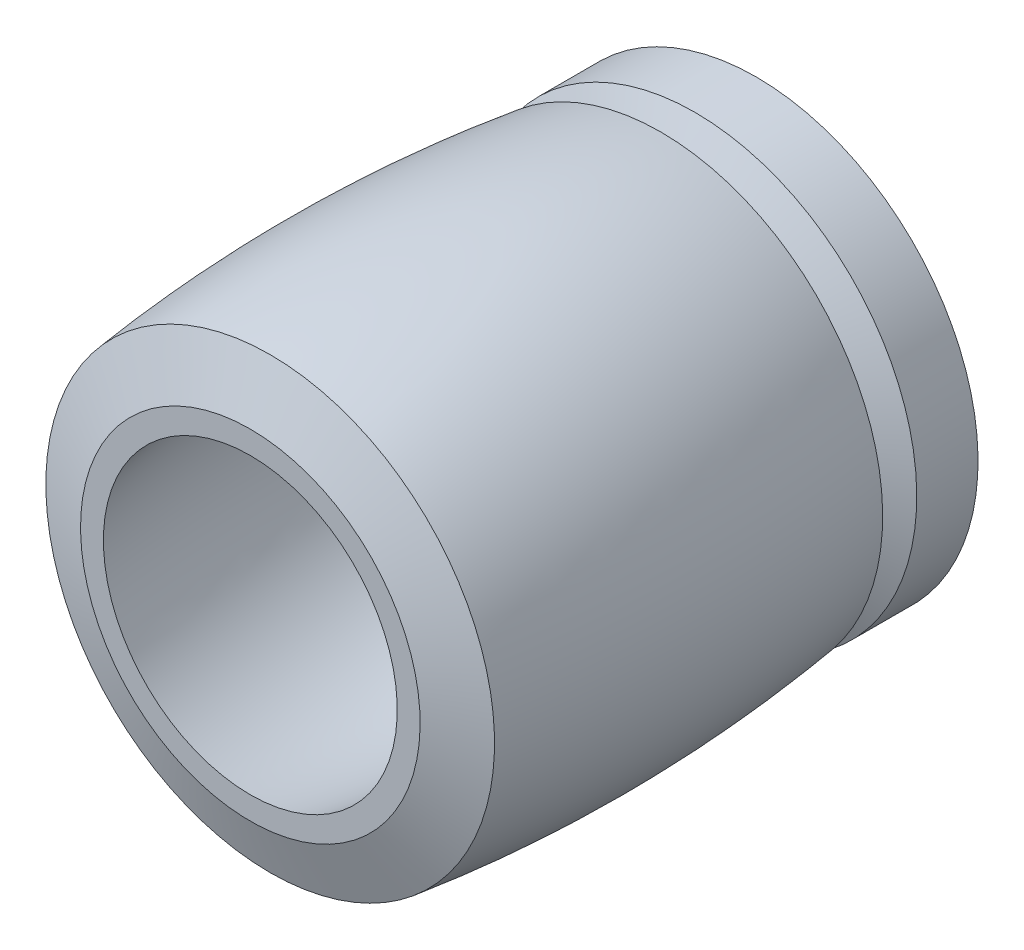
ISO-10303-21;
HEADER;
FILE_DESCRIPTION(('STEP AP214'),'2;1');
FILE_NAME('part.step','',(''),(''),'','','');
FILE_SCHEMA(('AUTOMOTIVE_DESIGN { 1 0 10303 214 1 1 1 1 }'));
ENDSEC;
DATA;
#1=APPLICATION_CONTEXT('core data for automotive mechanical design processes');
#2=APPLICATION_PROTOCOL_DEFINITION('international standard','automotive_design',2000,#1);
#3=PRODUCT_CONTEXT('',#1,'mechanical');
#4=PRODUCT('Part','Part','',(#3));
#5=PRODUCT_RELATED_PRODUCT_CATEGORY('part','',(#4));
#6=PRODUCT_DEFINITION_FORMATION('','',#4);
#7=PRODUCT_DEFINITION_CONTEXT('part definition',#1,'design');
#8=PRODUCT_DEFINITION('design','',#6,#7);
#9=PRODUCT_DEFINITION_SHAPE('','',#8);
#10=(LENGTH_UNIT() NAMED_UNIT(*) SI_UNIT(.MILLI.,.METRE.));
#11=(NAMED_UNIT(*) PLANE_ANGLE_UNIT() SI_UNIT($,.RADIAN.));
#12=(NAMED_UNIT(*) SI_UNIT($,.STERADIAN.) SOLID_ANGLE_UNIT());
#13=UNCERTAINTY_MEASURE_WITH_UNIT(LENGTH_MEASURE(1.E-05),#10,'distance_accuracy_value','');
#14=(GEOMETRIC_REPRESENTATION_CONTEXT(3) GLOBAL_UNCERTAINTY_ASSIGNED_CONTEXT((#13)) GLOBAL_UNIT_ASSIGNED_CONTEXT((#10,
#11,#12)) REPRESENTATION_CONTEXT('',''));
#15=CARTESIAN_POINT('',(0.,0.,0.));
#16=DIRECTION('',(0.,0.,1.));
#17=DIRECTION('',(1.,0.,0.));
#18=AXIS2_PLACEMENT_3D('',#15,#16,#17);
#19=CARTESIAN_POINT('',(0.,0.,0.));
#20=DIRECTION('',(0.,0.,-1.));
#21=DIRECTION('',(0.,1.,0.));
#22=AXIS2_PLACEMENT_3D('',#19,#20,#21);
#23=CYLINDRICAL_SURFACE('',#22,2.667);
#24=CARTESIAN_POINT('',(0.,0.,0.));
#25=DIRECTION('',(0.,0.,-1.));
#26=DIRECTION('',(0.,1.,0.));
#27=AXIS2_PLACEMENT_3D('',#24,#25,#26);
#28=CIRCLE('',#27,2.667);
#29=CARTESIAN_POINT('',(0.,2.667,0.));
#30=VERTEX_POINT('',#29);
#31=EDGE_CURVE('E15',#30,#30,#28,.F.);
#32=ORIENTED_EDGE('',*,*,#31,.F.);
#33=EDGE_LOOP('',(#32));
#34=FACE_BOUND('',#33,.T.);
#35=CARTESIAN_POINT('',(0.,0.,3.49580200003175));
#36=DIRECTION('',(0.,0.,1.));
#37=DIRECTION('',(0.,-1.,0.));
#38=AXIS2_PLACEMENT_3D('',#35,#36,#37);
#39=CIRCLE('',#38,2.66700000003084);
#40=CARTESIAN_POINT('',(0.,-2.66700000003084,3.49580200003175));
#41=VERTEX_POINT('',#40);
#42=EDGE_CURVE('E99',#41,#41,#39,.T.);
#43=ORIENTED_EDGE('',*,*,#42,.T.);
#44=EDGE_LOOP('',(#43));
#45=FACE_BOUND('',#44,.T.);
#46=ADVANCED_FACE('F12',(#34,#45),#23,.F.);
#47=CARTESIAN_POINT('',(0.,0.,4.59362645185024));
#48=DIRECTION('',(0.,0.,1.));
#49=DIRECTION('',(0.,-1.,0.));
#50=AXIS2_PLACEMENT_3D('',#47,#48,#49);
#51=CONICAL_SURFACE('',#50,5.68324789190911,1.22173047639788);
#52=CARTESIAN_POINT('',(0.,0.,4.59362645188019));
#53=DIRECTION('',(0.,0.,-1.));
#54=DIRECTION('',(0.,1.,0.));
#55=AXIS2_PLACEMENT_3D('',#52,#53,#54);
#56=CIRCLE('',#55,5.68324789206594);
#57=CARTESIAN_POINT('',(0.,5.68324789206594,4.59362645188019));
#58=VERTEX_POINT('',#57);
#59=EDGE_CURVE('E96',#58,#58,#56,.F.);
#60=ORIENTED_EDGE('',*,*,#59,.T.);
#61=EDGE_LOOP('',(#60));
#62=FACE_BOUND('',#61,.T.);
#63=ORIENTED_EDGE('',*,*,#42,.F.);
#64=EDGE_LOOP('',(#63));
#65=FACE_BOUND('',#64,.T.);
#66=ADVANCED_FACE('F46',(#62,#65),#51,.F.);
#67=CARTESIAN_POINT('',(2.667,0.,0.));
#68=DIRECTION('',(0.,0.,-1.));
#69=DIRECTION('',(0.,1.,0.));
#70=AXIS2_PLACEMENT_3D('',#67,#68,#69);
#71=PLANE('',#70);
#72=ORIENTED_EDGE('',*,*,#31,.T.);
#73=EDGE_LOOP('',(#72));
#74=FACE_BOUND('',#73,.T.);
#75=CARTESIAN_POINT('',(0.,0.,0.));
#76=DIRECTION('',(0.,0.,-1.));
#77=DIRECTION('',(0.,1.,0.));
#78=AXIS2_PLACEMENT_3D('',#75,#76,#77);
#79=CIRCLE('',#78,8.128);
#80=CARTESIAN_POINT('',(0.,8.128,0.));
#81=VERTEX_POINT('',#80);
#82=EDGE_CURVE('E92',#81,#81,#79,.F.);
#83=ORIENTED_EDGE('',*,*,#82,.F.);
#84=EDGE_LOOP('',(#83));
#85=FACE_BOUND('',#84,.T.);
#86=ADVANCED_FACE('F42',(#74,#85),#71,.T.);
#87=CARTESIAN_POINT('',(0.,-49.8961682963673,10.3817950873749));
#88=DIRECTION('',(1.,0.,0.));
#89=DIRECTION('',(0.,1.,0.));
#90=AXIS2_PLACEMENT_3D('',#87,#88,#89);
#91=CIRCLE('',#90,55.88);
#92=TRIMMED_CURVE('',#91,(PARAMETER_VALUE(-0.467014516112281)),
(PARAMETER_VALUE(0.467014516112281)),.T.,.PARAMETER.);
#93=CARTESIAN_POINT('',(0.,0.,10.3817950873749));
#94=DIRECTION('',(0.,0.,-1.));
#95=AXIS1_PLACEMENT('',#93,#94);
#96=SURFACE_OF_REVOLUTION('',#92,#95);
#97=ORIENTED_EDGE('',*,*,#59,.F.);
#98=EDGE_LOOP('',(#97));
#99=FACE_BOUND('',#98,.T.);
#100=CARTESIAN_POINT('',(0.,0.,18.542));
#101=DIRECTION('',(0.,0.,-1.));
#102=DIRECTION('',(0.,1.,0.));
#103=AXIS2_PLACEMENT_3D('',#100,#101,#102);
#104=CIRCLE('',#103,5.3848);
#105=CARTESIAN_POINT('',(0.,5.3848,18.542));
#106=VERTEX_POINT('',#105);
#107=EDGE_CURVE('E90',#106,#106,#104,.T.);
#108=ORIENTED_EDGE('',*,*,#107,.F.);
#109=EDGE_LOOP('',(#108));
#110=FACE_BOUND('',#109,.T.);
#111=ADVANCED_FACE('F37',(#99,#110),#96,.T.);
#112=CARTESIAN_POINT('',(0.,0.,0.));
#113=DIRECTION('',(0.,0.,-1.));
#114=DIRECTION('',(0.,1.,0.));
#115=AXIS2_PLACEMENT_3D('',#112,#113,#114);
#116=CYLINDRICAL_SURFACE('',#115,8.128);
#117=ORIENTED_EDGE('',*,*,#82,.T.);
#118=EDGE_LOOP('',(#117));
#119=FACE_BOUND('',#118,.T.);
#120=CARTESIAN_POINT('',(0.,0.,2.245868));
#121=DIRECTION('',(0.,0.,-1.));
#122=DIRECTION('',(0.,1.,0.));
#123=AXIS2_PLACEMENT_3D('',#120,#121,#122);
#124=CIRCLE('',#123,8.128);
#125=CARTESIAN_POINT('',(0.,8.128,2.245868));
#126=VERTEX_POINT('',#125);
#127=EDGE_CURVE('E34',#126,#126,#124,.F.);
#128=ORIENTED_EDGE('',*,*,#127,.F.);
#129=EDGE_LOOP('',(#128));
#130=FACE_BOUND('',#129,.T.);
#131=ADVANCED_FACE('F41',(#119,#130),#116,.T.);
#132=CARTESIAN_POINT('',(5.3848,0.,18.542));
#133=DIRECTION('',(0.,0.,1.));
#134=DIRECTION('',(0.,-1.,0.));
#135=AXIS2_PLACEMENT_3D('',#132,#133,#134);
#136=PLANE('',#135);
#137=CARTESIAN_POINT('',(0.,0.,18.542));
#138=DIRECTION('',(0.,0.,-1.));
#139=DIRECTION('',(0.,1.,0.));
#140=AXIS2_PLACEMENT_3D('',#137,#138,#139);
#141=CIRCLE('',#140,6.223);
#142=CARTESIAN_POINT('',(0.,6.223,18.542));
#143=VERTEX_POINT('',#142);
#144=EDGE_CURVE('E31',#143,#143,#141,.T.);
#145=ORIENTED_EDGE('',*,*,#144,.F.);
#146=EDGE_LOOP('',(#145));
#147=FACE_BOUND('',#146,.T.);
#148=ORIENTED_EDGE('',*,*,#107,.T.);
#149=EDGE_LOOP('',(#148));
#150=FACE_BOUND('',#149,.T.);
#151=ADVANCED_FACE('F76',(#147,#150),#136,.T.);
#152=CARTESIAN_POINT('',(0.,0.,2.245868));
#153=DIRECTION('',(0.,0.,-1.));
#154=DIRECTION('',(0.,1.,0.));
#155=AXIS2_PLACEMENT_3D('',#152,#153,#154);
#156=CONICAL_SURFACE('',#155,8.128,1.13446401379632);
#157=ORIENTED_EDGE('',*,*,#127,.T.);
#158=EDGE_LOOP('',(#157));
#159=FACE_BOUND('',#158,.T.);
#160=CARTESIAN_POINT('',(0.,0.,2.87083500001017));
#161=DIRECTION('',(0.,0.,1.));
#162=DIRECTION('',(0.,-1.,0.));
#163=AXIS2_PLACEMENT_3D('',#160,#161,#162);
#164=CIRCLE('',#163,6.78775394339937);
#165=CARTESIAN_POINT('',(0.,-6.78775394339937,2.87083500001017));
#166=VERTEX_POINT('',#165);
#167=EDGE_CURVE('E24',#166,#166,#164,.T.);
#168=ORIENTED_EDGE('',*,*,#167,.F.);
#169=EDGE_LOOP('',(#168));
#170=FACE_BOUND('',#169,.T.);
#171=ADVANCED_FACE('F73',(#159,#170),#156,.T.);
#172=CARTESIAN_POINT('',(0.,0.,17.8144307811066));
#173=DIRECTION('',(0.,0.,-1.));
#174=DIRECTION('',(0.,1.,0.));
#175=AXIS2_PLACEMENT_3D('',#172,#173,#174);
#176=CONICAL_SURFACE('',#175,8.22198,1.22173047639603);
#177=CARTESIAN_POINT('',(0.,0.,17.8144307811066));
#178=DIRECTION('',(0.,0.,-1.));
#179=DIRECTION('',(0.,1.,0.));
#180=AXIS2_PLACEMENT_3D('',#177,#178,#179);
#181=CIRCLE('',#180,8.22198);
#182=CARTESIAN_POINT('',(0.,8.22198,17.8144307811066));
#183=VERTEX_POINT('',#182);
#184=EDGE_CURVE('E19',#183,#183,#181,.T.);
#185=ORIENTED_EDGE('',*,*,#184,.F.);
#186=EDGE_LOOP('',(#185));
#187=FACE_BOUND('',#186,.T.);
#188=ORIENTED_EDGE('',*,*,#144,.T.);
#189=EDGE_LOOP('',(#188));
#190=FACE_BOUND('',#189,.T.);
#191=ADVANCED_FACE('F66',(#187,#190),#176,.T.);
#192=CARTESIAN_POINT('',(0.,0.,3.49580200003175));
#193=DIRECTION('',(0.,0.,1.));
#194=DIRECTION('',(-1.,0.,0.));
#195=AXIS2_PLACEMENT_3D('',#192,#193,#194);
#196=CONICAL_SURFACE('',#195,8.12800000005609,1.13446401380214);
#197=CARTESIAN_POINT('',(0.,0.,3.495802));
#198=DIRECTION('',(0.,0.,-1.));
#199=DIRECTION('',(0.,1.,0.));
#200=AXIS2_PLACEMENT_3D('',#197,#198,#199);
#201=CIRCLE('',#200,8.128);
#202=CARTESIAN_POINT('',(0.,8.128,3.495802));
#203=VERTEX_POINT('',#202);
#204=EDGE_CURVE('E8',#203,#203,#201,.F.);
#205=ORIENTED_EDGE('',*,*,#204,.F.);
#206=EDGE_LOOP('',(#205));
#207=FACE_BOUND('',#206,.T.);
#208=ORIENTED_EDGE('',*,*,#167,.T.);
#209=EDGE_LOOP('',(#208));
#210=FACE_BOUND('',#209,.T.);
#211=ADVANCED_FACE('F60',(#207,#210),#196,.T.);
#212=CARTESIAN_POINT('',(0.,-47.3316006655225,11.0194326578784));
#213=DIRECTION('',(1.,0.,0.));
#214=DIRECTION('',(0.,1.,0.));
#215=AXIS2_PLACEMENT_3D('',#212,#213,#214);
#216=CIRCLE('',#215,55.9676006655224);
#217=TRIMMED_CURVE('',#216,(PARAMETER_VALUE(-0.562927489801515)),
(PARAMETER_VALUE(0.562927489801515)),.T.,.PARAMETER.);
#218=CARTESIAN_POINT('',(0.,0.,11.0194326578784));
#219=DIRECTION('',(0.,0.,-1.));
#220=AXIS1_PLACEMENT('',#218,#219);
#221=SURFACE_OF_REVOLUTION('',#217,#220);
#222=ORIENTED_EDGE('',*,*,#204,.T.);
#223=EDGE_LOOP('',(#222));
#224=FACE_BOUND('',#223,.T.);
#225=ORIENTED_EDGE('',*,*,#184,.T.);
#226=EDGE_LOOP('',(#225));
#227=FACE_BOUND('',#226,.T.);
#228=ADVANCED_FACE('F58',(#224,#227),#221,.F.);
#229=CLOSED_SHELL('',(#46,#66,#86,#111,#131,#151,#171,#191,#211,#228));
#230=MANIFOLD_SOLID_BREP('B1',#229);
#231=ADVANCED_BREP_SHAPE_REPRESENTATION('',(#18,#230),#14);
#232=SHAPE_DEFINITION_REPRESENTATION(#9,#231);
ENDSEC;
END-ISO-10303-21;
